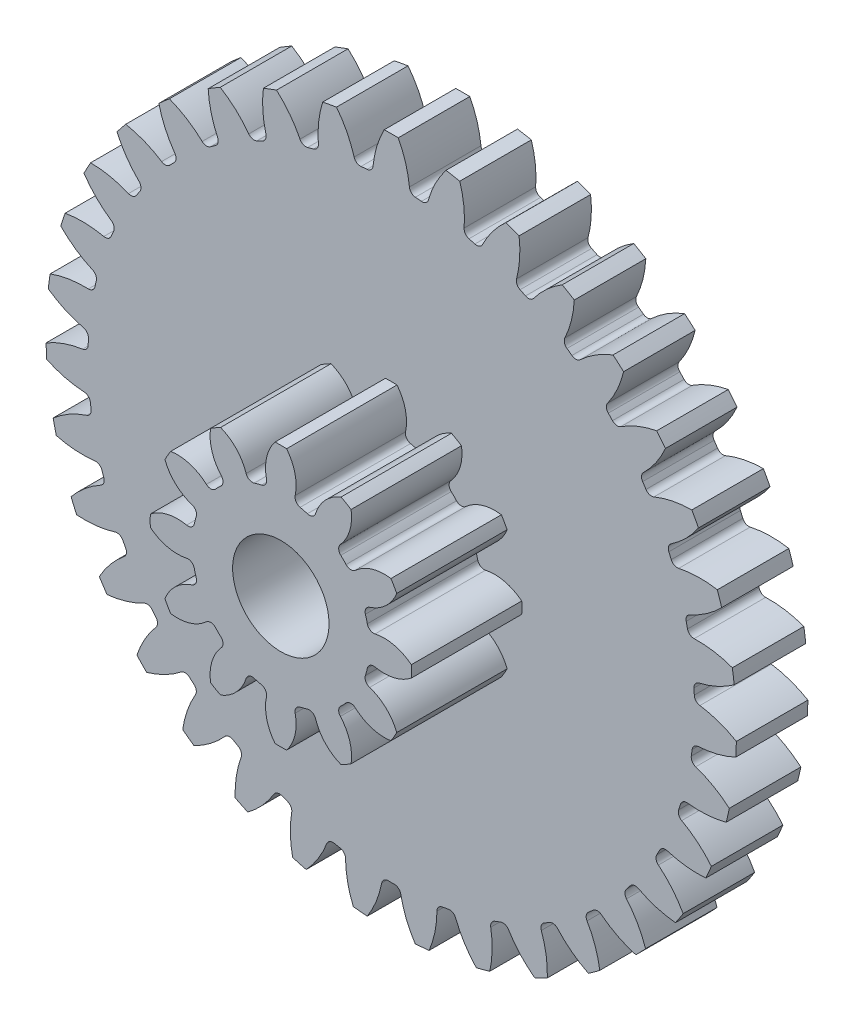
from build123d import *

# Parameters (mm, degrees)
BOSS_EXTRU_1_DEPTH                 = 2.3
CONG_1_R                           = 0.21
R_P_TITION_CIRCULAIRE4_COUNT       = 35
CONG_1_OF_R_P_TITION_CIRCULAIRE4_R = 0.21
BOSS_EXTRU_2_DEPTH                 = 3.55
CONG_2_R                           = 0.21
R_P_TITION_CIRCULAIRE5_COUNT       = 12
CONG_2_OF_R_P_TITION_CIRCULAIRE5_R = 0.21
ESQUISSE10_R                       = 1.55
ENL_V_MAT_EXTRU_4_DEPTH            = 19.033216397
ESQUISSE11_R                       = 2.5
ESQUISSE11_R_2                     = 1.5
EXTRUSION1_DEPTH                   = 0.3


with BuildPart() as part:
    # Esquisse3 → Boss.-Extru.1 (new body)
    with BuildSketch(Plane.XY):
        with BuildLine():
            Line((-2.252690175, 9.150396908), (-1.378706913, -0.560352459))
            Line((-1.378706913, -0.560352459), (-0.504723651, 9.150396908))
            ThreePointArc((-0.504723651, 9.150396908), (-0.643080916, 9.161856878), (-0.781587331, 9.171345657))
            ThreePointArc((-0.781587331, 9.171345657), (-0.892351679, 9.874840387), (-1.153571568, 10.537364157))
            ThreePointArc((-1.153571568, 10.537364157), (-1.378706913, 10.539647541), (-1.603842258, 10.537364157))
            ThreePointArc((-1.603842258, 10.537364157), (-1.865062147, 9.874840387), (-1.975826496, 9.171345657))
            ThreePointArc((-1.975826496, 9.171345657), (-2.11433291, 9.161856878), (-2.252690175, 9.150396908))
        make_face()
    boss_extru_1 = extrude(amount=BOSS_EXTRU_1_DEPTH)

    # Cong_1
    cong_1_edges = [part.edges().sort_by_distance(p)[0] for p in [
        (-1.975826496, 9.171345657, 1.15),
        (-0.781587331, 9.171345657, 1.15),
    ]]
    fillet(cong_1_edges, radius=CONG_1_R)

    # R_p_tition circulaire4: Boss.-Extru.1 ×35 about axis
    r_p_tition_circulaire4_axis = Axis((-1.378706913, -0.560352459, 0), (0, 0, 1))
    for i in range(1, R_P_TITION_CIRCULAIRE4_COUNT):
        add(boss_extru_1.rotate(r_p_tition_circulaire4_axis, i * 360 / R_P_TITION_CIRCULAIRE4_COUNT))

    # Cong_1 of R_p_tition circulaire4
    cong_1_of_r_p_tition_circulaire4_edges = [part.edges().sort_by_distance(p)[0] for p in [
        (-3.703892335, 8.908333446, 1.15),
        (-2.528845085, 9.121573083, 1.15),
        (-5.357224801, 8.340989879, 1.15),
        (-4.239136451, 8.760615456, 1.15),
        (-6.882684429, 7.487549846, 1.15),
        (-5.857491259, 8.10007425, 1.15),
        (-8.231241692, 6.37544361, 1.15),
        (-7.331894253, 7.161179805, 1.15),
        (-9.359552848, 5.040415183, 1.15),
        (-8.614956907, 5.974108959, 1.15),
        (-10.231353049, 3.525373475, 1.15),
        (-9.665440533, 4.577015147, 1.15),
        (-10.818621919, 1.879013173, 1.15),
        (-10.449581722, 3.014802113, 1.15),
        (-11.102484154, 0.154249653, 1.15),
        (-10.94217753, 1.337680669, 1.15),
        (-11.073816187, -1.593481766, 1.15),
        (-11.127395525, -0.400445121, 1.15),
        (-10.733539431, -3.30800756, 1.15),
        (-10.999282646, -2.143710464, 1.15),
        (-10.092590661, -4.934221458, 1.15),
        (-10.561956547, -3.836085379, 1.15),
        (-9.171570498, -6.419855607, 1.15),
        (-9.829473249, -5.423175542, 1.15),
        (-8.000081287, -7.717160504, 1.15),
        (-8.825375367, -6.85397057, 1.15),
        (-6.615775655, -8.784439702, 1.15),
        (-7.581935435, -8.082483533, 1.15),
        (-5.063146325, -9.587389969, 1.15),
        (-6.139118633, -9.069229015, 1.15),
        (-3.392096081, -10.100203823, 1.15),
        (-4.543298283, -9.782492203, 1.15),
        (-1.656333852, -10.306399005, 1.15),
        (-2.845765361, -10.199348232, 1.15),
        (0.088351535, -10.199348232, 1.15),
        (-1.101079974, -10.306399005, 1.15),
        (1.785884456, -9.782492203, 1.15),
        (0.634682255, -10.100203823, 1.15),
        (3.381704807, -9.069229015, 1.15),
        (2.305732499, -9.587389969, 1.15),
        (4.824521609, -8.082483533, 1.15),
        (3.858361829, -8.784439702, 1.15),
        (6.067961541, -6.85397057, 1.15),
        (5.24266746, -7.717160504, 1.15),
        (7.072059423, -5.423175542, 1.15),
        (6.414156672, -6.419855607, 1.15),
        (7.804542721, -3.836085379, 1.15),
        (7.335176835, -4.934221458, 1.15),
        (8.241868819, -2.143710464, 1.15),
        (7.976125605, -3.30800756, 1.15),
        (8.369981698, -0.400445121, 1.15),
        (8.316402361, -1.593481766, 1.15),
        (8.184763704, 1.337680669, 1.15),
        (8.345070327, 0.154249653, 1.15),
        (7.692167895, 3.014802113, 1.15),
        (8.061208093, 1.879013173, 1.15),
        (6.908026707, 4.577015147, 1.15),
        (7.473939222, 3.525373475, 1.15),
        (5.857543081, 5.974108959, 1.15),
        (6.602139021, 5.040415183, 1.15),
        (4.574480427, 7.161179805, 1.15),
        (5.473827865, 6.37544361, 1.15),
        (3.100077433, 8.10007425, 1.15),
        (4.125270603, 7.487549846, 1.15),
        (1.481722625, 8.760615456, 1.15),
        (2.599810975, 8.340989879, 1.15),
        (-0.228568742, 9.121573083, 1.15),
        (0.946478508, 8.908333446, 1.15),
    ]]
    fillet(cong_1_of_r_p_tition_circulaire4_edges, radius=CONG_1_OF_R_P_TITION_CIRCULAIRE4_R)

    # Esquisse8 → Boss.-Extru.2 (add)
    with BuildSketch(Plane.XY.offset(2.3)):
        with BuildLine():
            Line((-2.116341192, 2.192536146), (-1.378706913, -0.560352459))
            Line((-1.378706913, -0.560352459), (-0.641072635, 2.192536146))
            ThreePointArc((-0.641072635, 2.192536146), (-0.809409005, 2.23220907), (-0.979841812, 2.261598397))
            ThreePointArc((-0.979841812, 2.261598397), (-0.903476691, 2.976835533), (-1.192498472, 3.635517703))
            ThreePointArc((-1.192498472, 3.635517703), (-1.378706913, 3.639647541), (-1.564915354, 3.635517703))
            ThreePointArc((-1.564915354, 3.635517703), (-1.853937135, 2.976835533), (-1.777572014, 2.261598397))
            ThreePointArc((-1.777572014, 2.261598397), (-1.948004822, 2.23220907), (-2.116341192, 2.192536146))
        make_face()
    boss_extru_2 = extrude(amount=BOSS_EXTRU_2_DEPTH)

    # Cong_2
    cong_2_edges = [part.edges().sort_by_distance(p)[0] for p in [
        (-0.979841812, 2.261598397, 4.075),
        (-1.777572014, 2.261598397, 4.075),
    ]]
    fillet(cong_2_edges, radius=CONG_2_R)

    # R_p_tition circulaire5: Boss.-Extru.2 ×12 about axis
    r_p_tition_circulaire5_axis = Axis((-1.378706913, -0.560352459, 0), (0, 0, 1))
    for i in range(1, R_P_TITION_CIRCULAIRE5_COUNT):
        add(boss_extru_2.rotate(r_p_tition_circulaire5_axis, i * 360 / R_P_TITION_CIRCULAIRE5_COUNT))

    # Cong_2 of R_p_tition circulaire5
    cong_2_of_r_p_tition_circulaire5_edges = [part.edges().sort_by_distance(p)[0] for p in [
        (-2.444255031, 2.082961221, 4.075),
        (-3.135109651, 1.68409612, 4.075),
        (-3.623155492, 1.196050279, 4.075),
        (-4.022020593, 0.505195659, 4.075),
        (-4.200657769, -0.161487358, 4.075),
        (-4.200657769, -0.959217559, 4.075),
        (-4.022020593, -1.625900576, 4.075),
        (-3.623155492, -2.316755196, 4.075),
        (-3.135109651, -2.804801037, 4.075),
        (-2.444255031, -3.203666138, 4.075),
        (-1.777572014, -3.382303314, 4.075),
        (-0.979841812, -3.382303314, 4.075),
        (-0.313158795, -3.203666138, 4.075),
        (0.377695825, -2.804801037, 4.075),
        (0.865741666, -2.316755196, 4.075),
        (1.264606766, -1.625900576, 4.075),
        (1.443243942, -0.959217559, 4.075),
        (1.443243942, -0.161487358, 4.075),
        (1.264606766, 0.505195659, 4.075),
        (0.865741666, 1.196050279, 4.075),
        (0.377695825, 1.68409612, 4.075),
        (-0.313158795, 2.082961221, 4.075),
    ]]
    fillet(cong_2_of_r_p_tition_circulaire5_edges, radius=CONG_2_OF_R_P_TITION_CIRCULAIRE5_R)

    # Esquisse10 → Enl_v. mat.-Extru.4 (cut, through all)
    with BuildSketch(Plane.XY):
        with Locations((-1.378706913, -0.560352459)):
            Circle(ESQUISSE10_R)
    extrude(amount=ENL_V_MAT_EXTRU_4_DEPTH, mode=Mode.SUBTRACT)

    # Esquisse11 → Extrusion1 (add)
    with BuildSketch(Plane(origin=(0, 0, 0), x_dir=(-1, 0, 0), z_dir=(0, 0, -1))):
        with Locations(Location((1.378706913, -0.560352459, 0), (0, 0, 180))):
            Circle(ESQUISSE11_R)
        with Locations((1.378706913, -0.560352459)):
            Circle(ESQUISSE11_R_2, mode=Mode.SUBTRACT)
    extrude(amount=EXTRUSION1_DEPTH)


solid = part.part
